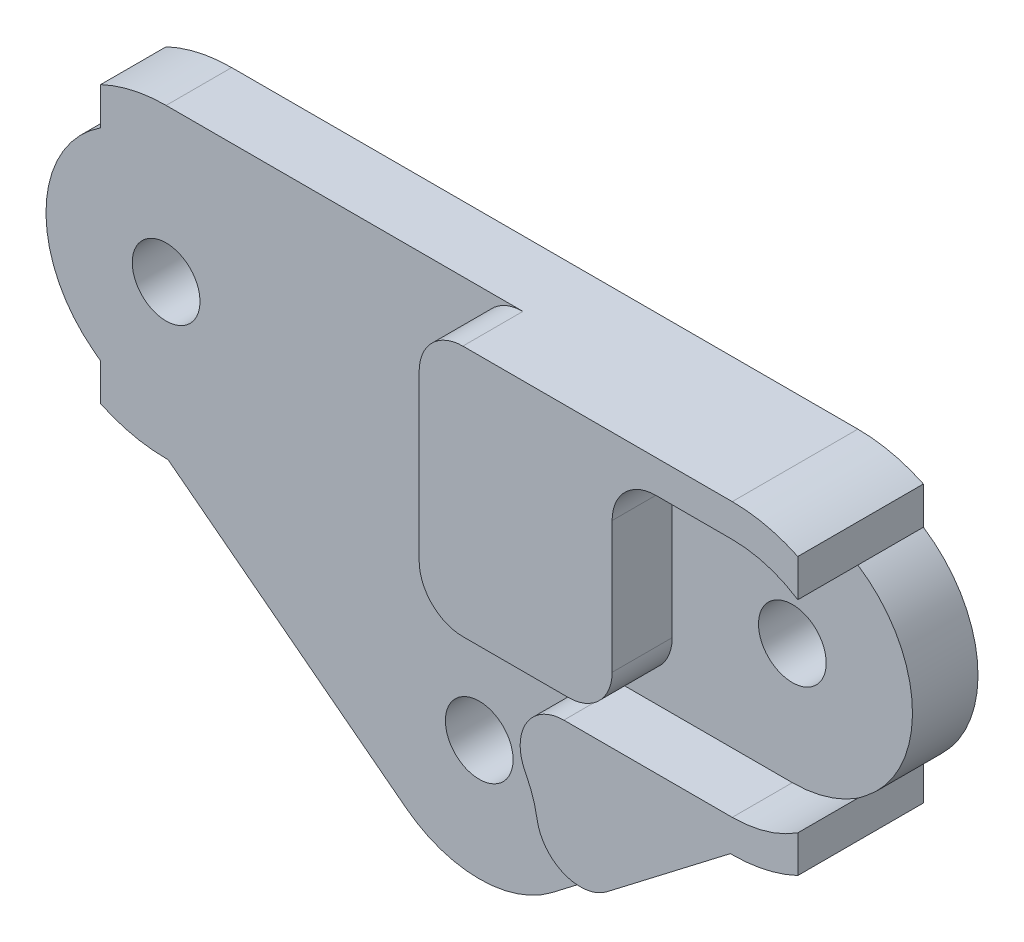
ISO-10303-21;
HEADER;
FILE_DESCRIPTION(('STEP AP214'),'2;1');
FILE_NAME('part.step','',(''),(''),'','','');
FILE_SCHEMA(('AUTOMOTIVE_DESIGN { 1 0 10303 214 1 1 1 1 }'));
ENDSEC;
DATA;
#1=APPLICATION_CONTEXT('core data for automotive mechanical design processes');
#2=APPLICATION_PROTOCOL_DEFINITION('international standard','automotive_design',2000,#1);
#3=PRODUCT_CONTEXT('',#1,'mechanical');
#4=PRODUCT('Part','Part','',(#3));
#5=PRODUCT_RELATED_PRODUCT_CATEGORY('part','',(#4));
#6=PRODUCT_DEFINITION_FORMATION('','',#4);
#7=PRODUCT_DEFINITION_CONTEXT('part definition',#1,'design');
#8=PRODUCT_DEFINITION('design','',#6,#7);
#9=PRODUCT_DEFINITION_SHAPE('','',#8);
#10=(LENGTH_UNIT() NAMED_UNIT(*) SI_UNIT(.MILLI.,.METRE.));
#11=(NAMED_UNIT(*) PLANE_ANGLE_UNIT() SI_UNIT($,.RADIAN.));
#12=(NAMED_UNIT(*) SI_UNIT($,.STERADIAN.) SOLID_ANGLE_UNIT());
#13=UNCERTAINTY_MEASURE_WITH_UNIT(LENGTH_MEASURE(1.E-05),#10,'distance_accuracy_value','');
#14=(GEOMETRIC_REPRESENTATION_CONTEXT(3) GLOBAL_UNCERTAINTY_ASSIGNED_CONTEXT((#13)) GLOBAL_UNIT_ASSIGNED_CONTEXT((#10,
#11,#12)) REPRESENTATION_CONTEXT('',''));
#15=CARTESIAN_POINT('',(0.,0.,0.));
#16=DIRECTION('',(0.,0.,1.));
#17=DIRECTION('',(1.,0.,0.));
#18=AXIS2_PLACEMENT_3D('',#15,#16,#17);
#19=CARTESIAN_POINT('',(14.3333333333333,0.,3.));
#20=DIRECTION('',(0.,0.,-1.));
#21=DIRECTION('',(-1.,0.,0.));
#22=AXIS2_PLACEMENT_3D('',#19,#20,#21);
#23=PLANE('',#22);
#24=CARTESIAN_POINT('',(0.,-11.,3.));
#25=DIRECTION('',(0.,0.,1.));
#26=DIRECTION('',(1.,0.,0.));
#27=AXIS2_PLACEMENT_3D('',#24,#25,#26);
#28=CIRCLE('',#27,1.55);
#29=CARTESIAN_POINT('',(1.55,-11.,3.));
#30=VERTEX_POINT('',#29);
#31=EDGE_CURVE('E661',#30,#30,#28,.T.);
#32=ORIENTED_EDGE('',*,*,#31,.F.);
#33=EDGE_LOOP('',(#32));
#34=FACE_BOUND('',#33,.T.);
#35=CARTESIAN_POINT('',(14.3333333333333,0.,3.));
#36=DIRECTION('',(0.,0.,1.));
#37=DIRECTION('',(1.,0.,0.));
#38=AXIS2_PLACEMENT_3D('',#35,#36,#37);
#39=CIRCLE('',#38,1.55);
#40=CARTESIAN_POINT('',(15.8833333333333,0.,3.));
#41=VERTEX_POINT('',#40);
#42=EDGE_CURVE('E669',#41,#41,#39,.T.);
#43=ORIENTED_EDGE('',*,*,#42,.F.);
#44=EDGE_LOOP('',(#43));
#45=FACE_BOUND('',#44,.T.);
#46=CARTESIAN_POINT('',(-14.3333333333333,0.,3.));
#47=DIRECTION('',(0.,0.,1.));
#48=DIRECTION('',(-1.,0.,0.));
#49=AXIS2_PLACEMENT_3D('',#46,#47,#48);
#50=CIRCLE('',#49,1.55);
#51=CARTESIAN_POINT('',(-15.8833333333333,0.,3.));
#52=VERTEX_POINT('',#51);
#53=EDGE_CURVE('E653',#52,#52,#50,.T.);
#54=ORIENTED_EDGE('',*,*,#53,.F.);
#55=EDGE_LOOP('',(#54));
#56=FACE_BOUND('',#55,.T.);
#57=DIRECTION('',(1.,0.,0.));
#58=VECTOR('',#57,1.);
#59=CARTESIAN_POINT('',(14.3333333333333,5.5,3.));
#60=LINE('',#59,#58);
#61=CARTESIAN_POINT('',(10.8333333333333,5.5,3.));
#62=VERTEX_POINT('',#61);
#63=CARTESIAN_POINT('',(14.3333333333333,5.5,3.));
#64=VERTEX_POINT('',#63);
#65=EDGE_CURVE('E395',#62,#64,#60,.T.);
#66=ORIENTED_EDGE('',*,*,#65,.F.);
#67=CARTESIAN_POINT('',(10.8333333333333,3.5,3.));
#68=DIRECTION('',(0.,0.,-1.));
#69=DIRECTION('',(-1.,0.,0.));
#70=AXIS2_PLACEMENT_3D('',#67,#68,#69);
#71=CIRCLE('',#70,2.);
#72=CARTESIAN_POINT('',(8.83333333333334,3.5,3.));
#73=VERTEX_POINT('',#72);
#74=EDGE_CURVE('E59',#62,#73,#71,.F.);
#75=ORIENTED_EDGE('',*,*,#74,.T.);
#76=DIRECTION('',(0.,1.,0.));
#77=VECTOR('',#76,1.);
#78=CARTESIAN_POINT('',(8.83333333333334,5.5,3.));
#79=LINE('',#78,#77);
#80=CARTESIAN_POINT('',(8.83333333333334,-2.51751640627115,3.));
#81=VERTEX_POINT('',#80);
#82=EDGE_CURVE('E431',#81,#73,#79,.T.);
#83=ORIENTED_EDGE('',*,*,#82,.F.);
#84=CARTESIAN_POINT('',(6.83333333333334,-2.51751640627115,3.));
#85=DIRECTION('',(0.,0.,-1.));
#86=DIRECTION('',(-1.,0.,0.));
#87=AXIS2_PLACEMENT_3D('',#84,#85,#86);
#88=CIRCLE('',#87,2.);
#89=CARTESIAN_POINT('',(6.83333333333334,-4.51751640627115,3.));
#90=VERTEX_POINT('',#89);
#91=EDGE_CURVE('E49',#81,#90,#88,.T.);
#92=ORIENTED_EDGE('',*,*,#91,.T.);
#93=DIRECTION('',(1.,0.,0.));
#94=VECTOR('',#93,1.);
#95=CARTESIAN_POINT('',(8.83333333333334,-4.51751640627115,3.));
#96=LINE('',#95,#94);
#97=CARTESIAN_POINT('',(2.,-4.51751640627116,3.));
#98=VERTEX_POINT('',#97);
#99=EDGE_CURVE('E427',#98,#90,#96,.T.);
#100=ORIENTED_EDGE('',*,*,#99,.F.);
#101=CARTESIAN_POINT('',(2.,-2.51751640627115,3.));
#102=DIRECTION('',(0.,0.,-1.));
#103=DIRECTION('',(-1.,0.,0.));
#104=AXIS2_PLACEMENT_3D('',#101,#102,#103);
#105=CIRCLE('',#104,2.);
#106=CARTESIAN_POINT('',(0.,-2.51751640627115,3.));
#107=VERTEX_POINT('',#106);
#108=EDGE_CURVE('E582',#98,#107,#105,.T.);
#109=ORIENTED_EDGE('',*,*,#108,.T.);
#110=DIRECTION('',(0.,-1.,0.));
#111=VECTOR('',#110,1.);
#112=CARTESIAN_POINT('',(0.,-4.51751640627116,3.));
#113=LINE('',#112,#111);
#114=CARTESIAN_POINT('',(0.,5.,3.));
#115=VERTEX_POINT('',#114);
#116=EDGE_CURVE('E426',#115,#107,#113,.T.);
#117=ORIENTED_EDGE('',*,*,#116,.F.);
#118=CARTESIAN_POINT('',(2.,5.,3.));
#119=DIRECTION('',(0.,0.,-1.));
#120=DIRECTION('',(-1.,0.,0.));
#121=AXIS2_PLACEMENT_3D('',#118,#119,#120);
#122=CIRCLE('',#121,2.);
#123=CARTESIAN_POINT('',(2.,7.,3.));
#124=VERTEX_POINT('',#123);
#125=EDGE_CURVE('E578',#115,#124,#122,.T.);
#126=ORIENTED_EDGE('',*,*,#125,.T.);
#127=DIRECTION('',(-1.,0.,0.));
#128=VECTOR('',#127,1.);
#129=CARTESIAN_POINT('',(0.,7.,3.));
#130=LINE('',#129,#128);
#131=CARTESIAN_POINT('',(-14.3333333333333,7.,3.));
#132=VERTEX_POINT('',#131);
#133=EDGE_CURVE('E506',#124,#132,#130,.T.);
#134=ORIENTED_EDGE('',*,*,#133,.T.);
#135=CARTESIAN_POINT('',(-14.3333333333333,0.,3.));
#136=DIRECTION('',(0.,0.,1.));
#137=DIRECTION('',(1.,0.,0.));
#138=AXIS2_PLACEMENT_3D('',#135,#136,#137);
#139=CIRCLE('',#138,6.99999999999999);
#140=CARTESIAN_POINT('',(-17.3333333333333,6.32455532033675,3.));
#141=VERTEX_POINT('',#140);
#142=EDGE_CURVE('E502',#132,#141,#139,.T.);
#143=ORIENTED_EDGE('',*,*,#142,.T.);
#144=DIRECTION('',(0.,-1.,0.));
#145=VECTOR('',#144,1.);
#146=CARTESIAN_POINT('',(-17.3333333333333,0.,3.));
#147=LINE('',#146,#145);
#148=CARTESIAN_POINT('',(-17.3333333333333,4.60977222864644,3.));
#149=VERTEX_POINT('',#148);
#150=EDGE_CURVE('E497',#141,#149,#147,.T.);
#151=ORIENTED_EDGE('',*,*,#150,.T.);
#152=CARTESIAN_POINT('',(-14.3333333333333,0.,3.));
#153=DIRECTION('',(0.,0.,1.));
#154=DIRECTION('',(1.,0.,0.));
#155=AXIS2_PLACEMENT_3D('',#152,#153,#154);
#156=CIRCLE('',#155,5.5);
#157=CARTESIAN_POINT('',(-17.6818366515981,-4.36320129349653,3.));
#158=VERTEX_POINT('',#157);
#159=EDGE_CURVE('E681',#149,#158,#156,.T.);
#160=ORIENTED_EDGE('',*,*,#159,.T.);
#161=DIRECTION('',(0.793309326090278,-0.60881878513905,0.));
#162=VECTOR('',#161,1.);
#163=CARTESIAN_POINT('',(-3.34850331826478,-15.3632012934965,3.));
#164=LINE('',#163,#162);
#165=CARTESIAN_POINT('',(-17.3333333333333,-4.63065732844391,3.));
#166=VERTEX_POINT('',#165);
#167=EDGE_CURVE('E685',#158,#166,#164,.T.);
#168=ORIENTED_EDGE('',*,*,#167,.T.);
#169=DIRECTION('',(0.,-1.,0.));
#170=VECTOR('',#169,1.);
#171=CARTESIAN_POINT('',(-17.3333333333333,0.,3.));
#172=LINE('',#171,#170);
#173=CARTESIAN_POINT('',(-17.3333333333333,-6.32455532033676,3.));
#174=VERTEX_POINT('',#173);
#175=EDGE_CURVE('E447',#166,#174,#172,.T.);
#176=ORIENTED_EDGE('',*,*,#175,.T.);
#177=CARTESIAN_POINT('',(-14.3333333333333,0.,3.));
#178=DIRECTION('',(0.,0.,1.));
#179=DIRECTION('',(1.,0.,0.));
#180=AXIS2_PLACEMENT_3D('',#177,#178,#179);
#181=CIRCLE('',#180,7.00000000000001);
#182=CARTESIAN_POINT('',(-14.3333333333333,-7.,3.));
#183=VERTEX_POINT('',#182);
#184=EDGE_CURVE('E467',#174,#183,#181,.T.);
#185=ORIENTED_EDGE('',*,*,#184,.T.);
#186=DIRECTION('',(1.,0.,0.));
#187=VECTOR('',#186,1.);
#188=CARTESIAN_POINT('',(0.,-7.,3.));
#189=LINE('',#188,#187);
#190=CARTESIAN_POINT('',(-14.246008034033,-7.00000000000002,3.));
#191=VERTEX_POINT('',#190);
#192=EDGE_CURVE('E462',#183,#191,#189,.T.);
#193=ORIENTED_EDGE('',*,*,#192,.T.);
#194=CARTESIAN_POINT('',(-3.34850331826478,-15.3632012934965,3.));
#195=VERTEX_POINT('',#194);
#196=EDGE_CURVE('E684',#191,#195,#164,.T.);
#197=ORIENTED_EDGE('',*,*,#196,.T.);
#198=CARTESIAN_POINT('',(0.,-11.,3.));
#199=DIRECTION('',(0.,0.,1.));
#200=DIRECTION('',(1.,0.,0.));
#201=AXIS2_PLACEMENT_3D('',#198,#199,#200);
#202=CIRCLE('',#201,5.5);
#203=CARTESIAN_POINT('',(3.34850331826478,-15.3632012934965,3.));
#204=VERTEX_POINT('',#203);
#205=EDGE_CURVE('E689',#195,#204,#202,.T.);
#206=ORIENTED_EDGE('',*,*,#205,.T.);
#207=DIRECTION('',(0.793309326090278,0.608818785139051,0.));
#208=VECTOR('',#207,1.);
#209=CARTESIAN_POINT('',(3.34850331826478,-15.3632012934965,3.));
#210=LINE('',#209,#208);
#211=CARTESIAN_POINT('',(8.59500527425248,-11.3368160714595,3.));
#212=VERTEX_POINT('',#211);
#213=EDGE_CURVE('E693',#204,#212,#210,.T.);
#214=ORIENTED_EDGE('',*,*,#213,.T.);
#215=CARTESIAN_POINT('',(7.37736770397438,-9.75019741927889,3.));
#216=DIRECTION('',(0.,0.,-1.));
#217=DIRECTION('',(-1.,0.,0.));
#218=AXIS2_PLACEMENT_3D('',#215,#216,#217);
#219=CIRCLE('',#218,2.);
#220=CARTESIAN_POINT('',(5.40546422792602,-10.0842583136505,3.));
#221=VERTEX_POINT('',#220);
#222=EDGE_CURVE('E588',#212,#221,#219,.T.);
#223=ORIENTED_EDGE('',*,*,#222,.T.);
#224=CARTESIAN_POINT('',(0.,-11.,3.));
#225=DIRECTION('',(0.,0.,-1.));
#226=DIRECTION('',(-1.,0.,0.));
#227=AXIS2_PLACEMENT_3D('',#224,#225,#226);
#228=CIRCLE('',#227,5.48248359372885);
#229=CARTESIAN_POINT('',(4.85249650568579,-8.44835268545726,3.));
#230=VERTEX_POINT('',#229);
#231=EDGE_CURVE('E372',#230,#221,#228,.T.);
#232=ORIENTED_EDGE('',*,*,#231,.F.);
#233=CARTESIAN_POINT('',(6.62267836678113,-7.51751640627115,3.));
#234=DIRECTION('',(0.,0.,-1.));
#235=DIRECTION('',(-1.,0.,0.));
#236=AXIS2_PLACEMENT_3D('',#233,#234,#235);
#237=CIRCLE('',#236,2.);
#238=CARTESIAN_POINT('',(6.62267836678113,-5.51751640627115,3.));
#239=VERTEX_POINT('',#238);
#240=EDGE_CURVE('E585',#230,#239,#237,.T.);
#241=ORIENTED_EDGE('',*,*,#240,.T.);
#242=DIRECTION('',(-1.,0.,0.));
#243=VECTOR('',#242,1.);
#244=CARTESIAN_POINT('',(14.3333333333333,-5.51751640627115,3.));
#245=LINE('',#244,#243);
#246=CARTESIAN_POINT('',(14.3333333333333,-5.51751640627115,3.));
#247=VERTEX_POINT('',#246);
#248=EDGE_CURVE('E379',#247,#239,#245,.T.);
#249=ORIENTED_EDGE('',*,*,#248,.F.);
#250=CARTESIAN_POINT('',(14.3333333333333,0.,3.));
#251=DIRECTION('',(0.,0.,-1.));
#252=DIRECTION('',(-1.,0.,0.));
#253=AXIS2_PLACEMENT_3D('',#250,#251,#252);
#254=CIRCLE('',#253,5.51751640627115);
#255=CARTESIAN_POINT('',(17.3333333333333,-4.63065732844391,3.));
#256=VERTEX_POINT('',#255);
#257=EDGE_CURVE('E376',#256,#247,#254,.T.);
#258=ORIENTED_EDGE('',*,*,#257,.F.);
#259=CARTESIAN_POINT('',(17.6818366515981,-4.36320129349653,3.));
#260=VERTEX_POINT('',#259);
#261=EDGE_CURVE('E692',#256,#260,#210,.T.);
#262=ORIENTED_EDGE('',*,*,#261,.T.);
#263=CARTESIAN_POINT('',(14.3333333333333,0.,3.));
#264=DIRECTION('',(0.,0.,1.));
#265=DIRECTION('',(-1.,0.,0.));
#266=AXIS2_PLACEMENT_3D('',#263,#264,#265);
#267=CIRCLE('',#266,5.5);
#268=CARTESIAN_POINT('',(17.3333333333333,4.60977222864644,3.));
#269=VERTEX_POINT('',#268);
#270=EDGE_CURVE('E677',#260,#269,#267,.T.);
#271=ORIENTED_EDGE('',*,*,#270,.T.);
#272=CARTESIAN_POINT('',(14.3333333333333,0.,3.));
#273=DIRECTION('',(0.,0.,-1.));
#274=DIRECTION('',(-1.,0.,0.));
#275=AXIS2_PLACEMENT_3D('',#272,#273,#274);
#276=CIRCLE('',#275,5.5);
#277=EDGE_CURVE('E389',#64,#269,#276,.T.);
#278=ORIENTED_EDGE('',*,*,#277,.F.);
#279=EDGE_LOOP('',(#66,#75,#83,#92,#100,#109,#117,#126,#134,#143,#151,#160,#168,#176,#185,#193,
#197,#206,#214,#223,#232,#241,#249,#258,#262,#271,#278));
#280=FACE_BOUND('',#279,.T.);
#281=ADVANCED_FACE('F40',(#34,#45,#56,#280),#23,.F.);
#282=CARTESIAN_POINT('',(3.34850331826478,-15.3632012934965,3.));
#283=DIRECTION('',(-0.608818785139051,0.793309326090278,0.));
#284=DIRECTION('',(-0.793309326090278,-0.608818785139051,0.));
#285=AXIS2_PLACEMENT_3D('',#282,#283,#284);
#286=PLANE('',#285);
#287=DIRECTION('',(0.793309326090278,0.60881878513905,0.));
#288=VECTOR('',#287,1.);
#289=CARTESIAN_POINT('',(5.48248359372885,-13.7254955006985,5.75));
#290=LINE('',#289,#288);
#291=CARTESIAN_POINT('',(8.59500527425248,-11.3368160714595,5.75));
#292=VERTEX_POINT('',#291);
#293=CARTESIAN_POINT('',(14.246008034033,-7.,5.75));
#294=VERTEX_POINT('',#293);
#295=EDGE_CURVE('E322',#292,#294,#290,.T.);
#296=ORIENTED_EDGE('',*,*,#295,.F.);
#297=DIRECTION('',(0.,0.,-1.));
#298=VECTOR('',#297,1.);
#299=CARTESIAN_POINT('',(8.59500527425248,-11.3368160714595,3.));
#300=LINE('',#299,#298);
#301=EDGE_CURVE('E563',#292,#212,#300,.T.);
#302=ORIENTED_EDGE('',*,*,#301,.T.);
#303=ORIENTED_EDGE('',*,*,#213,.F.);
#304=DIRECTION('',(0.,0.,-1.));
#305=VECTOR('',#304,1.);
#306=CARTESIAN_POINT('',(3.34850331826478,-15.3632012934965,3.));
#307=LINE('',#306,#305);
#308=CARTESIAN_POINT('',(3.34850331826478,-15.3632012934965,0.));
#309=VERTEX_POINT('',#308);
#310=EDGE_CURVE('E717',#204,#309,#307,.T.);
#311=ORIENTED_EDGE('',*,*,#310,.T.);
#312=DIRECTION('',(0.793309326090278,0.608818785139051,0.));
#313=VECTOR('',#312,1.);
#314=CARTESIAN_POINT('',(3.34850331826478,-15.3632012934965,0.));
#315=LINE('',#314,#313);
#316=CARTESIAN_POINT('',(14.246008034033,-7.,0.));
#317=VERTEX_POINT('',#316);
#318=EDGE_CURVE('E344',#309,#317,#315,.T.);
#319=ORIENTED_EDGE('',*,*,#318,.T.);
#320=DIRECTION('',(0.,0.,1.));
#321=VECTOR('',#320,1.);
#322=CARTESIAN_POINT('',(14.246008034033,-7.,-34.748970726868));
#323=LINE('',#322,#321);
#324=EDGE_CURVE('E340',#317,#294,#323,.T.);
#325=ORIENTED_EDGE('',*,*,#324,.T.);
#326=EDGE_LOOP('',(#296,#302,#303,#311,#319,#325));
#327=FACE_BOUND('',#326,.T.);
#328=ADVANCED_FACE('F341',(#327),#286,.F.);
#329=DIRECTION('',(0.,0.,1.));
#330=VECTOR('',#329,1.);
#331=CARTESIAN_POINT('',(17.3333333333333,-4.63065732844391,-34.748970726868));
#332=LINE('',#331,#330);
#333=CARTESIAN_POINT('',(17.3333333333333,-4.63065732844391,0.));
#334=VERTEX_POINT('',#333);
#335=EDGE_CURVE('E348',#334,#256,#332,.T.);
#336=ORIENTED_EDGE('',*,*,#335,.F.);
#337=CARTESIAN_POINT('',(17.6818366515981,-4.36320129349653,0.));
#338=VERTEX_POINT('',#337);
#339=EDGE_CURVE('E711',#334,#338,#315,.T.);
#340=ORIENTED_EDGE('',*,*,#339,.T.);
#341=DIRECTION('',(0.,0.,-1.));
#342=VECTOR('',#341,1.);
#343=CARTESIAN_POINT('',(17.6818366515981,-4.36320129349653,3.));
#344=LINE('',#343,#342);
#345=EDGE_CURVE('E696',#260,#338,#344,.T.);
#346=ORIENTED_EDGE('',*,*,#345,.F.);
#347=ORIENTED_EDGE('',*,*,#261,.F.);
#348=EDGE_LOOP('',(#336,#340,#346,#347));
#349=FACE_BOUND('',#348,.T.);
#350=ADVANCED_FACE('F788',(#349),#286,.F.);
#351=CARTESIAN_POINT('',(-3.34850331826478,-15.3632012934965,3.));
#352=DIRECTION('',(0.60881878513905,0.793309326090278,0.));
#353=DIRECTION('',(-0.793309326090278,0.60881878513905,0.));
#354=AXIS2_PLACEMENT_3D('',#351,#352,#353);
#355=PLANE('',#354);
#356=ORIENTED_EDGE('',*,*,#196,.F.);
#357=DIRECTION('',(0.,0.,1.));
#358=VECTOR('',#357,1.);
#359=CARTESIAN_POINT('',(-14.246008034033,-7.00000000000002,-34.748970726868));
#360=LINE('',#359,#358);
#361=CARTESIAN_POINT('',(-14.246008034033,-7.,0.));
#362=VERTEX_POINT('',#361);
#363=EDGE_CURVE('E487',#362,#191,#360,.T.);
#364=ORIENTED_EDGE('',*,*,#363,.F.);
#365=DIRECTION('',(0.793309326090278,-0.60881878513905,0.));
#366=VECTOR('',#365,1.);
#367=CARTESIAN_POINT('',(-3.34850331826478,-15.3632012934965,0.));
#368=LINE('',#367,#366);
#369=CARTESIAN_POINT('',(-3.34850331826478,-15.3632012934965,0.));
#370=VERTEX_POINT('',#369);
#371=EDGE_CURVE('E703',#362,#370,#368,.T.);
#372=ORIENTED_EDGE('',*,*,#371,.T.);
#373=DIRECTION('',(0.,0.,-1.));
#374=VECTOR('',#373,1.);
#375=CARTESIAN_POINT('',(-3.34850331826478,-15.3632012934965,3.));
#376=LINE('',#375,#374);
#377=EDGE_CURVE('E719',#195,#370,#376,.T.);
#378=ORIENTED_EDGE('',*,*,#377,.F.);
#379=EDGE_LOOP('',(#356,#364,#372,#378));
#380=FACE_BOUND('',#379,.T.);
#381=ADVANCED_FACE('F805',(#380),#355,.F.);
#382=CARTESIAN_POINT('',(14.3333333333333,0.,3.));
#383=DIRECTION('',(0.,0.,-1.));
#384=DIRECTION('',(-1.,0.,0.));
#385=AXIS2_PLACEMENT_3D('',#382,#383,#384);
#386=CYLINDRICAL_SURFACE('',#385,5.5);
#387=DIRECTION('',(0.,0.,1.));
#388=VECTOR('',#387,1.);
#389=CARTESIAN_POINT('',(17.3333333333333,4.60977222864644,-34.748970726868));
#390=LINE('',#389,#388);
#391=CARTESIAN_POINT('',(17.3333333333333,4.60977222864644,0.));
#392=VERTEX_POINT('',#391);
#393=EDGE_CURVE('E635',#392,#269,#390,.T.);
#394=ORIENTED_EDGE('',*,*,#393,.T.);
#395=ORIENTED_EDGE('',*,*,#270,.F.);
#396=ORIENTED_EDGE('',*,*,#345,.T.);
#397=CARTESIAN_POINT('',(14.3333333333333,0.,0.));
#398=DIRECTION('',(0.,0.,1.));
#399=DIRECTION('',(-1.,0.,0.));
#400=AXIS2_PLACEMENT_3D('',#397,#398,#399);
#401=CIRCLE('',#400,5.5);
#402=EDGE_CURVE('E673',#338,#392,#401,.T.);
#403=ORIENTED_EDGE('',*,*,#402,.T.);
#404=EDGE_LOOP('',(#394,#395,#396,#403));
#405=FACE_BOUND('',#404,.T.);
#406=ADVANCED_FACE('F797',(#405),#386,.T.);
#407=CARTESIAN_POINT('',(14.3333333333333,0.,0.));
#408=DIRECTION('',(0.,0.,-1.));
#409=DIRECTION('',(-1.,0.,0.));
#410=AXIS2_PLACEMENT_3D('',#407,#408,#409);
#411=PLANE('',#410);
#412=CARTESIAN_POINT('',(0.,-11.,0.));
#413=DIRECTION('',(0.,0.,1.));
#414=DIRECTION('',(1.,0.,0.));
#415=AXIS2_PLACEMENT_3D('',#412,#413,#414);
#416=CIRCLE('',#415,1.55);
#417=CARTESIAN_POINT('',(1.55,-11.,0.));
#418=VERTEX_POINT('',#417);
#419=EDGE_CURVE('E657',#418,#418,#416,.T.);
#420=ORIENTED_EDGE('',*,*,#419,.T.);
#421=EDGE_LOOP('',(#420));
#422=FACE_BOUND('',#421,.T.);
#423=ORIENTED_EDGE('',*,*,#402,.F.);
#424=ORIENTED_EDGE('',*,*,#339,.F.);
#425=DIRECTION('',(0.,-1.,0.));
#426=VECTOR('',#425,1.);
#427=CARTESIAN_POINT('',(17.3333333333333,0.,0.));
#428=LINE('',#427,#426);
#429=CARTESIAN_POINT('',(17.3333333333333,-6.32455532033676,0.));
#430=VERTEX_POINT('',#429);
#431=EDGE_CURVE('E452',#334,#430,#428,.T.);
#432=ORIENTED_EDGE('',*,*,#431,.T.);
#433=CARTESIAN_POINT('',(14.3333333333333,0.,0.));
#434=DIRECTION('',(0.,0.,-1.));
#435=DIRECTION('',(-1.,0.,0.));
#436=AXIS2_PLACEMENT_3D('',#433,#434,#435);
#437=CIRCLE('',#436,7.);
#438=CARTESIAN_POINT('',(14.3333333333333,-7.,0.));
#439=VERTEX_POINT('',#438);
#440=EDGE_CURVE('E448',#430,#439,#437,.T.);
#441=ORIENTED_EDGE('',*,*,#440,.T.);
#442=DIRECTION('',(-1.,0.,0.));
#443=VECTOR('',#442,1.);
#444=CARTESIAN_POINT('',(0.,-7.,0.));
#445=LINE('',#444,#443);
#446=EDGE_CURVE('E444',#439,#317,#445,.T.);
#447=ORIENTED_EDGE('',*,*,#446,.T.);
#448=ORIENTED_EDGE('',*,*,#318,.F.);
#449=CARTESIAN_POINT('',(0.,-11.,0.));
#450=DIRECTION('',(0.,0.,1.));
#451=DIRECTION('',(1.,0.,0.));
#452=AXIS2_PLACEMENT_3D('',#449,#450,#451);
#453=CIRCLE('',#452,5.5);
#454=EDGE_CURVE('E708',#370,#309,#453,.T.);
#455=ORIENTED_EDGE('',*,*,#454,.F.);
#456=ORIENTED_EDGE('',*,*,#371,.F.);
#457=DIRECTION('',(1.,0.,0.));
#458=VECTOR('',#457,1.);
#459=CARTESIAN_POINT('',(0.,-7.,0.));
#460=LINE('',#459,#458);
#461=CARTESIAN_POINT('',(-14.3333333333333,-7.,0.));
#462=VERTEX_POINT('',#461);
#463=EDGE_CURVE('E484',#462,#362,#460,.T.);
#464=ORIENTED_EDGE('',*,*,#463,.F.);
#465=CARTESIAN_POINT('',(-14.3333333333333,0.,0.));
#466=DIRECTION('',(0.,0.,-1.));
#467=DIRECTION('',(-1.,0.,0.));
#468=AXIS2_PLACEMENT_3D('',#465,#466,#467);
#469=CIRCLE('',#468,7.00000000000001);
#470=CARTESIAN_POINT('',(-17.3333333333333,-6.32455532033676,0.));
#471=VERTEX_POINT('',#470);
#472=EDGE_CURVE('E466',#471,#462,#469,.F.);
#473=ORIENTED_EDGE('',*,*,#472,.F.);
#474=DIRECTION('',(0.,-1.,0.));
#475=VECTOR('',#474,1.);
#476=CARTESIAN_POINT('',(-17.3333333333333,0.,0.));
#477=LINE('',#476,#475);
#478=CARTESIAN_POINT('',(-17.3333333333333,-4.63065732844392,0.));
#479=VERTEX_POINT('',#478);
#480=EDGE_CURVE('E478',#479,#471,#477,.T.);
#481=ORIENTED_EDGE('',*,*,#480,.F.);
#482=CARTESIAN_POINT('',(-17.6818366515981,-4.36320129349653,0.));
#483=VERTEX_POINT('',#482);
#484=EDGE_CURVE('E704',#483,#479,#368,.T.);
#485=ORIENTED_EDGE('',*,*,#484,.F.);
#486=CARTESIAN_POINT('',(-14.3333333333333,0.,0.));
#487=DIRECTION('',(0.,0.,1.));
#488=DIRECTION('',(1.,0.,0.));
#489=AXIS2_PLACEMENT_3D('',#486,#487,#488);
#490=CIRCLE('',#489,5.5);
#491=CARTESIAN_POINT('',(-17.3333333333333,4.60977222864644,0.));
#492=VERTEX_POINT('',#491);
#493=EDGE_CURVE('E700',#492,#483,#490,.T.);
#494=ORIENTED_EDGE('',*,*,#493,.F.);
#495=DIRECTION('',(0.,-1.,0.));
#496=VECTOR('',#495,1.);
#497=CARTESIAN_POINT('',(-17.3333333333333,0.,0.));
#498=LINE('',#497,#496);
#499=CARTESIAN_POINT('',(-17.3333333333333,6.32455532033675,0.));
#500=VERTEX_POINT('',#499);
#501=EDGE_CURVE('E638',#500,#492,#498,.T.);
#502=ORIENTED_EDGE('',*,*,#501,.F.);
#503=CARTESIAN_POINT('',(-14.3333333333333,0.,0.));
#504=DIRECTION('',(0.,0.,-1.));
#505=DIRECTION('',(-1.,0.,0.));
#506=AXIS2_PLACEMENT_3D('',#503,#504,#505);
#507=CIRCLE('',#506,6.99999999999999);
#508=CARTESIAN_POINT('',(-14.3333333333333,7.,0.));
#509=VERTEX_POINT('',#508);
#510=EDGE_CURVE('E501',#509,#500,#507,.F.);
#511=ORIENTED_EDGE('',*,*,#510,.F.);
#512=DIRECTION('',(-1.,0.,0.));
#513=VECTOR('',#512,1.);
#514=CARTESIAN_POINT('',(0.,7.,0.));
#515=LINE('',#514,#513);
#516=CARTESIAN_POINT('',(14.3333333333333,7.,0.));
#517=VERTEX_POINT('',#516);
#518=EDGE_CURVE('E630',#517,#509,#515,.T.);
#519=ORIENTED_EDGE('',*,*,#518,.F.);
#520=CARTESIAN_POINT('',(14.3333333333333,0.,0.));
#521=DIRECTION('',(0.,0.,-1.));
#522=DIRECTION('',(-1.,0.,0.));
#523=AXIS2_PLACEMENT_3D('',#520,#521,#522);
#524=CIRCLE('',#523,7.);
#525=CARTESIAN_POINT('',(17.3333333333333,6.32455532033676,0.));
#526=VERTEX_POINT('',#525);
#527=EDGE_CURVE('E496',#517,#526,#524,.T.);
#528=ORIENTED_EDGE('',*,*,#527,.T.);
#529=DIRECTION('',(0.,-1.,0.));
#530=VECTOR('',#529,1.);
#531=CARTESIAN_POINT('',(17.3333333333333,0.,0.));
#532=LINE('',#531,#530);
#533=EDGE_CURVE('E514',#526,#392,#532,.T.);
#534=ORIENTED_EDGE('',*,*,#533,.T.);
#535=EDGE_LOOP('',(#423,#424,#432,#441,#447,#448,#455,#456,#464,#473,#481,#485,#494,#502,#511,
#519,#528,#534));
#536=FACE_BOUND('',#535,.T.);
#537=CARTESIAN_POINT('',(14.3333333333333,0.,0.));
#538=DIRECTION('',(0.,0.,1.));
#539=DIRECTION('',(1.,0.,0.));
#540=AXIS2_PLACEMENT_3D('',#537,#538,#539);
#541=CIRCLE('',#540,1.55);
#542=CARTESIAN_POINT('',(15.8833333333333,0.,0.));
#543=VERTEX_POINT('',#542);
#544=EDGE_CURVE('E665',#543,#543,#541,.T.);
#545=ORIENTED_EDGE('',*,*,#544,.T.);
#546=EDGE_LOOP('',(#545));
#547=FACE_BOUND('',#546,.T.);
#548=CARTESIAN_POINT('',(-14.3333333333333,0.,0.));
#549=DIRECTION('',(0.,0.,1.));
#550=DIRECTION('',(-1.,0.,0.));
#551=AXIS2_PLACEMENT_3D('',#548,#549,#550);
#552=CIRCLE('',#551,1.55);
#553=CARTESIAN_POINT('',(-15.8833333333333,0.,0.));
#554=VERTEX_POINT('',#553);
#555=EDGE_CURVE('E652',#554,#554,#552,.T.);
#556=ORIENTED_EDGE('',*,*,#555,.T.);
#557=EDGE_LOOP('',(#556));
#558=FACE_BOUND('',#557,.T.);
#559=ADVANCED_FACE('F738',(#422,#536,#547,#558),#411,.T.);
#560=CARTESIAN_POINT('',(-14.3333333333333,0.,3.));
#561=DIRECTION('',(0.,0.,-1.));
#562=DIRECTION('',(-1.,0.,0.));
#563=AXIS2_PLACEMENT_3D('',#560,#561,#562);
#564=CYLINDRICAL_SURFACE('',#563,5.5);
#565=ORIENTED_EDGE('',*,*,#159,.F.);
#566=DIRECTION('',(0.,0.,1.));
#567=VECTOR('',#566,1.);
#568=CARTESIAN_POINT('',(-17.3333333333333,4.60977222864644,-34.748970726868));
#569=LINE('',#568,#567);
#570=EDGE_CURVE('E643',#492,#149,#569,.T.);
#571=ORIENTED_EDGE('',*,*,#570,.F.);
#572=ORIENTED_EDGE('',*,*,#493,.T.);
#573=DIRECTION('',(0.,0.,-1.));
#574=VECTOR('',#573,1.);
#575=CARTESIAN_POINT('',(-17.6818366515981,-4.36320129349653,3.));
#576=LINE('',#575,#574);
#577=EDGE_CURVE('E515',#158,#483,#576,.T.);
#578=ORIENTED_EDGE('',*,*,#577,.F.);
#579=EDGE_LOOP('',(#565,#571,#572,#578));
#580=FACE_BOUND('',#579,.T.);
#581=ADVANCED_FACE('F746',(#580),#564,.T.);
#582=ORIENTED_EDGE('',*,*,#484,.T.);
#583=DIRECTION('',(0.,0.,1.));
#584=VECTOR('',#583,1.);
#585=CARTESIAN_POINT('',(-17.3333333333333,-4.63065732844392,-34.748970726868));
#586=LINE('',#585,#584);
#587=EDGE_CURVE('E483',#479,#166,#586,.T.);
#588=ORIENTED_EDGE('',*,*,#587,.T.);
#589=ORIENTED_EDGE('',*,*,#167,.F.);
#590=ORIENTED_EDGE('',*,*,#577,.T.);
#591=EDGE_LOOP('',(#582,#588,#589,#590));
#592=FACE_BOUND('',#591,.T.);
#593=ADVANCED_FACE('F732',(#592),#355,.F.);
#594=CARTESIAN_POINT('',(0.,-11.,3.));
#595=DIRECTION('',(0.,0.,-1.));
#596=DIRECTION('',(-1.,0.,0.));
#597=AXIS2_PLACEMENT_3D('',#594,#595,#596);
#598=CYLINDRICAL_SURFACE('',#597,5.5);
#599=ORIENTED_EDGE('',*,*,#454,.T.);
#600=ORIENTED_EDGE('',*,*,#310,.F.);
#601=ORIENTED_EDGE('',*,*,#205,.F.);
#602=ORIENTED_EDGE('',*,*,#377,.T.);
#603=EDGE_LOOP('',(#599,#600,#601,#602));
#604=FACE_BOUND('',#603,.T.);
#605=ADVANCED_FACE('F800',(#604),#598,.T.);
#606=CARTESIAN_POINT('',(14.3333333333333,0.,3.));
#607=DIRECTION('',(0.,0.,-1.));
#608=DIRECTION('',(-1.,0.,0.));
#609=AXIS2_PLACEMENT_3D('',#606,#607,#608);
#610=CYLINDRICAL_SURFACE('',#609,1.55);
#611=ORIENTED_EDGE('',*,*,#42,.T.);
#612=EDGE_LOOP('',(#611));
#613=FACE_BOUND('',#612,.T.);
#614=ORIENTED_EDGE('',*,*,#544,.F.);
#615=EDGE_LOOP('',(#614));
#616=FACE_BOUND('',#615,.T.);
#617=ADVANCED_FACE('F794',(#613,#616),#610,.F.);
#618=CARTESIAN_POINT('',(0.,-11.,3.));
#619=DIRECTION('',(0.,0.,-1.));
#620=DIRECTION('',(-1.,0.,0.));
#621=AXIS2_PLACEMENT_3D('',#618,#619,#620);
#622=CYLINDRICAL_SURFACE('',#621,1.55);
#623=ORIENTED_EDGE('',*,*,#31,.T.);
#624=EDGE_LOOP('',(#623));
#625=FACE_BOUND('',#624,.T.);
#626=ORIENTED_EDGE('',*,*,#419,.F.);
#627=EDGE_LOOP('',(#626));
#628=FACE_BOUND('',#627,.T.);
#629=ADVANCED_FACE('F834',(#625,#628),#622,.F.);
#630=CARTESIAN_POINT('',(-14.3333333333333,0.,3.));
#631=DIRECTION('',(0.,0.,-1.));
#632=DIRECTION('',(-1.,0.,0.));
#633=AXIS2_PLACEMENT_3D('',#630,#631,#632);
#634=CYLINDRICAL_SURFACE('',#633,1.55);
#635=ORIENTED_EDGE('',*,*,#53,.T.);
#636=EDGE_LOOP('',(#635));
#637=FACE_BOUND('',#636,.T.);
#638=ORIENTED_EDGE('',*,*,#555,.F.);
#639=EDGE_LOOP('',(#638));
#640=FACE_BOUND('',#639,.T.);
#641=ADVANCED_FACE('F832',(#637,#640),#634,.F.);
#642=CARTESIAN_POINT('',(-14.3333333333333,0.,-34.748970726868));
#643=DIRECTION('',(0.,0.,1.));
#644=DIRECTION('',(1.,0.,0.));
#645=AXIS2_PLACEMENT_3D('',#642,#643,#644);
#646=CYLINDRICAL_SURFACE('',#645,6.99999999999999);
#647=DIRECTION('',(0.,0.,1.));
#648=VECTOR('',#647,1.);
#649=CARTESIAN_POINT('',(-14.3333333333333,7.,-34.748970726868));
#650=LINE('',#649,#648);
#651=EDGE_CURVE('E633',#509,#132,#650,.T.);
#652=ORIENTED_EDGE('',*,*,#651,.F.);
#653=ORIENTED_EDGE('',*,*,#510,.T.);
#654=DIRECTION('',(0.,0.,1.));
#655=VECTOR('',#654,1.);
#656=CARTESIAN_POINT('',(-17.3333333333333,6.32455532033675,-34.748970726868));
#657=LINE('',#656,#655);
#658=EDGE_CURVE('E646',#500,#141,#657,.T.);
#659=ORIENTED_EDGE('',*,*,#658,.T.);
#660=ORIENTED_EDGE('',*,*,#142,.F.);
#661=EDGE_LOOP('',(#652,#653,#659,#660));
#662=FACE_BOUND('',#661,.T.);
#663=ADVANCED_FACE('F755',(#662),#646,.T.);
#664=CARTESIAN_POINT('',(-17.3333333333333,0.,-34.748970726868));
#665=DIRECTION('',(-1.,0.,0.));
#666=DIRECTION('',(0.,0.,1.));
#667=AXIS2_PLACEMENT_3D('',#664,#665,#666);
#668=PLANE('',#667);
#669=ORIENTED_EDGE('',*,*,#658,.F.);
#670=ORIENTED_EDGE('',*,*,#501,.T.);
#671=ORIENTED_EDGE('',*,*,#570,.T.);
#672=ORIENTED_EDGE('',*,*,#150,.F.);
#673=EDGE_LOOP('',(#669,#670,#671,#672));
#674=FACE_BOUND('',#673,.T.);
#675=ADVANCED_FACE('F749',(#674),#668,.T.);
#676=CARTESIAN_POINT('',(17.3333333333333,0.,-34.748970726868));
#677=DIRECTION('',(-1.,0.,0.));
#678=DIRECTION('',(0.,0.,1.));
#679=AXIS2_PLACEMENT_3D('',#676,#677,#678);
#680=PLANE('',#679);
#681=ORIENTED_EDGE('',*,*,#533,.F.);
#682=DIRECTION('',(0.,0.,1.));
#683=VECTOR('',#682,1.);
#684=CARTESIAN_POINT('',(17.3333333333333,6.32455532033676,-34.748970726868));
#685=LINE('',#684,#683);
#686=CARTESIAN_POINT('',(17.3333333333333,6.32455532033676,5.75));
#687=VERTEX_POINT('',#686);
#688=EDGE_CURVE('E623',#526,#687,#685,.T.);
#689=ORIENTED_EDGE('',*,*,#688,.T.);
#690=DIRECTION('',(0.,1.,0.));
#691=VECTOR('',#690,1.);
#692=CARTESIAN_POINT('',(17.3333333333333,6.32455532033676,5.75));
#693=LINE('',#692,#691);
#694=CARTESIAN_POINT('',(17.3333333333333,4.60977222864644,5.75));
#695=VERTEX_POINT('',#694);
#696=EDGE_CURVE('E394',#695,#687,#693,.T.);
#697=ORIENTED_EDGE('',*,*,#696,.F.);
#698=DIRECTION('',(0.,0.,-1.));
#699=VECTOR('',#698,1.);
#700=CARTESIAN_POINT('',(17.3333333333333,4.60977222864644,5.75));
#701=LINE('',#700,#699);
#702=EDGE_CURVE('E439',#695,#269,#701,.T.);
#703=ORIENTED_EDGE('',*,*,#702,.T.);
#704=ORIENTED_EDGE('',*,*,#393,.F.);
#705=EDGE_LOOP('',(#681,#689,#697,#703,#704));
#706=FACE_BOUND('',#705,.T.);
#707=ADVANCED_FACE('F819',(#706),#680,.F.);
#708=CARTESIAN_POINT('',(14.3333333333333,0.,-34.748970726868));
#709=DIRECTION('',(0.,0.,1.));
#710=DIRECTION('',(1.,0.,0.));
#711=AXIS2_PLACEMENT_3D('',#708,#709,#710);
#712=CYLINDRICAL_SURFACE('',#711,7.);
#713=ORIENTED_EDGE('',*,*,#527,.F.);
#714=DIRECTION('',(0.,0.,1.));
#715=VECTOR('',#714,1.);
#716=CARTESIAN_POINT('',(14.3333333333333,7.,-34.748970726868));
#717=LINE('',#716,#715);
#718=CARTESIAN_POINT('',(14.3333333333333,7.,5.75));
#719=VERTEX_POINT('',#718);
#720=EDGE_CURVE('E626',#517,#719,#717,.T.);
#721=ORIENTED_EDGE('',*,*,#720,.T.);
#722=CARTESIAN_POINT('',(14.3333333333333,0.,5.75));
#723=DIRECTION('',(0.,0.,1.));
#724=DIRECTION('',(1.,0.,0.));
#725=AXIS2_PLACEMENT_3D('',#722,#723,#724);
#726=CIRCLE('',#725,7.);
#727=EDGE_CURVE('E399',#687,#719,#726,.T.);
#728=ORIENTED_EDGE('',*,*,#727,.F.);
#729=ORIENTED_EDGE('',*,*,#688,.F.);
#730=EDGE_LOOP('',(#713,#721,#728,#729));
#731=FACE_BOUND('',#730,.T.);
#732=ADVANCED_FACE('F622',(#731),#712,.T.);
#733=CARTESIAN_POINT('',(0.,7.,-34.748970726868));
#734=DIRECTION('',(0.,1.,0.));
#735=DIRECTION('',(-1.,0.,0.));
#736=AXIS2_PLACEMENT_3D('',#733,#734,#735);
#737=PLANE('',#736);
#738=ORIENTED_EDGE('',*,*,#133,.F.);
#739=DIRECTION('',(0.,0.,-1.));
#740=VECTOR('',#739,1.);
#741=CARTESIAN_POINT('',(2.,7.,5.75));
#742=LINE('',#741,#740);
#743=CARTESIAN_POINT('',(2.,7.,5.75));
#744=VERTEX_POINT('',#743);
#745=EDGE_CURVE('E529',#124,#744,#742,.F.);
#746=ORIENTED_EDGE('',*,*,#745,.T.);
#747=DIRECTION('',(-1.,0.,0.));
#748=VECTOR('',#747,1.);
#749=CARTESIAN_POINT('',(14.3333333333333,7.,5.75));
#750=LINE('',#749,#748);
#751=EDGE_CURVE('E403',#719,#744,#750,.T.);
#752=ORIENTED_EDGE('',*,*,#751,.F.);
#753=ORIENTED_EDGE('',*,*,#720,.F.);
#754=ORIENTED_EDGE('',*,*,#518,.T.);
#755=ORIENTED_EDGE('',*,*,#651,.T.);
#756=EDGE_LOOP('',(#738,#746,#752,#753,#754,#755));
#757=FACE_BOUND('',#756,.T.);
#758=ADVANCED_FACE('F757',(#757),#737,.T.);
#759=CARTESIAN_POINT('',(-14.3333333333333,0.,-34.748970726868));
#760=DIRECTION('',(0.,0.,1.));
#761=DIRECTION('',(1.,0.,0.));
#762=AXIS2_PLACEMENT_3D('',#759,#760,#761);
#763=CYLINDRICAL_SURFACE('',#762,7.00000000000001);
#764=DIRECTION('',(0.,0.,1.));
#765=VECTOR('',#764,1.);
#766=CARTESIAN_POINT('',(-17.3333333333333,-6.32455532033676,-34.748970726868));
#767=LINE('',#766,#765);
#768=EDGE_CURVE('E482',#471,#174,#767,.T.);
#769=ORIENTED_EDGE('',*,*,#768,.F.);
#770=ORIENTED_EDGE('',*,*,#472,.T.);
#771=DIRECTION('',(0.,0.,1.));
#772=VECTOR('',#771,1.);
#773=CARTESIAN_POINT('',(-14.3333333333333,-7.,-34.748970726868));
#774=LINE('',#773,#772);
#775=EDGE_CURVE('E477',#462,#183,#774,.T.);
#776=ORIENTED_EDGE('',*,*,#775,.T.);
#777=ORIENTED_EDGE('',*,*,#184,.F.);
#778=EDGE_LOOP('',(#769,#770,#776,#777));
#779=FACE_BOUND('',#778,.T.);
#780=ADVANCED_FACE('F902',(#779),#763,.T.);
#781=CARTESIAN_POINT('',(0.,-7.,-34.748970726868));
#782=DIRECTION('',(0.,-1.,0.));
#783=DIRECTION('',(0.,0.,-1.));
#784=AXIS2_PLACEMENT_3D('',#781,#782,#783);
#785=PLANE('',#784);
#786=ORIENTED_EDGE('',*,*,#775,.F.);
#787=ORIENTED_EDGE('',*,*,#463,.T.);
#788=ORIENTED_EDGE('',*,*,#363,.T.);
#789=ORIENTED_EDGE('',*,*,#192,.F.);
#790=EDGE_LOOP('',(#786,#787,#788,#789));
#791=FACE_BOUND('',#790,.T.);
#792=ADVANCED_FACE('F1094',(#791),#785,.T.);
#793=CARTESIAN_POINT('',(-17.3333333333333,0.,-34.748970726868));
#794=DIRECTION('',(-1.,0.,0.));
#795=DIRECTION('',(0.,0.,1.));
#796=AXIS2_PLACEMENT_3D('',#793,#794,#795);
#797=PLANE('',#796);
#798=ORIENTED_EDGE('',*,*,#587,.F.);
#799=ORIENTED_EDGE('',*,*,#480,.T.);
#800=ORIENTED_EDGE('',*,*,#768,.T.);
#801=ORIENTED_EDGE('',*,*,#175,.F.);
#802=EDGE_LOOP('',(#798,#799,#800,#801));
#803=FACE_BOUND('',#802,.T.);
#804=ADVANCED_FACE('F743',(#803),#797,.T.);
#805=CARTESIAN_POINT('',(14.3333333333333,0.,-34.748970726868));
#806=DIRECTION('',(0.,0.,1.));
#807=DIRECTION('',(1.,0.,0.));
#808=AXIS2_PLACEMENT_3D('',#805,#806,#807);
#809=CYLINDRICAL_SURFACE('',#808,7.);
#810=ORIENTED_EDGE('',*,*,#440,.F.);
#811=DIRECTION('',(0.,0.,1.));
#812=VECTOR('',#811,1.);
#813=CARTESIAN_POINT('',(17.3333333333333,-6.32455532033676,-34.748970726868));
#814=LINE('',#813,#812);
#815=CARTESIAN_POINT('',(17.3333333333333,-6.32455532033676,5.75));
#816=VERTEX_POINT('',#815);
#817=EDGE_CURVE('E443',#430,#816,#814,.T.);
#818=ORIENTED_EDGE('',*,*,#817,.T.);
#819=CARTESIAN_POINT('',(14.3333333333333,0.,5.75));
#820=DIRECTION('',(0.,0.,1.));
#821=DIRECTION('',(1.,0.,0.));
#822=AXIS2_PLACEMENT_3D('',#819,#820,#821);
#823=CIRCLE('',#822,7.);
#824=CARTESIAN_POINT('',(14.3333333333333,-7.,5.75));
#825=VERTEX_POINT('',#824);
#826=EDGE_CURVE('E354',#825,#816,#823,.T.);
#827=ORIENTED_EDGE('',*,*,#826,.F.);
#828=DIRECTION('',(0.,0.,1.));
#829=VECTOR('',#828,1.);
#830=CARTESIAN_POINT('',(14.3333333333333,-7.,-34.748970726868));
#831=LINE('',#830,#829);
#832=EDGE_CURVE('E349',#439,#825,#831,.T.);
#833=ORIENTED_EDGE('',*,*,#832,.F.);
#834=EDGE_LOOP('',(#810,#818,#827,#833));
#835=FACE_BOUND('',#834,.T.);
#836=ADVANCED_FACE('F1053',(#835),#809,.T.);
#837=CARTESIAN_POINT('',(0.,-7.,-34.748970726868));
#838=DIRECTION('',(0.,1.,0.));
#839=DIRECTION('',(0.,0.,1.));
#840=AXIS2_PLACEMENT_3D('',#837,#838,#839);
#841=PLANE('',#840);
#842=ORIENTED_EDGE('',*,*,#446,.F.);
#843=ORIENTED_EDGE('',*,*,#832,.T.);
#844=DIRECTION('',(1.,0.,0.));
#845=VECTOR('',#844,1.);
#846=CARTESIAN_POINT('',(14.246008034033,-7.,5.75));
#847=LINE('',#846,#845);
#848=EDGE_CURVE('E328',#294,#825,#847,.T.);
#849=ORIENTED_EDGE('',*,*,#848,.F.);
#850=ORIENTED_EDGE('',*,*,#324,.F.);
#851=EDGE_LOOP('',(#842,#843,#849,#850));
#852=FACE_BOUND('',#851,.T.);
#853=ADVANCED_FACE('F351',(#852),#841,.F.);
#854=CARTESIAN_POINT('',(17.3333333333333,0.,-34.748970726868));
#855=DIRECTION('',(-1.,0.,0.));
#856=DIRECTION('',(0.,0.,1.));
#857=AXIS2_PLACEMENT_3D('',#854,#855,#856);
#858=PLANE('',#857);
#859=ORIENTED_EDGE('',*,*,#431,.F.);
#860=ORIENTED_EDGE('',*,*,#335,.T.);
#861=DIRECTION('',(0.,0.,-1.));
#862=VECTOR('',#861,1.);
#863=CARTESIAN_POINT('',(17.3333333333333,-4.63065732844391,5.75));
#864=LINE('',#863,#862);
#865=CARTESIAN_POINT('',(17.3333333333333,-4.63065732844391,5.75));
#866=VERTEX_POINT('',#865);
#867=EDGE_CURVE('E386',#866,#256,#864,.T.);
#868=ORIENTED_EDGE('',*,*,#867,.F.);
#869=DIRECTION('',(0.,1.,0.));
#870=VECTOR('',#869,1.);
#871=CARTESIAN_POINT('',(17.3333333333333,-4.63065732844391,5.75));
#872=LINE('',#871,#870);
#873=EDGE_CURVE('E359',#816,#866,#872,.T.);
#874=ORIENTED_EDGE('',*,*,#873,.F.);
#875=ORIENTED_EDGE('',*,*,#817,.F.);
#876=EDGE_LOOP('',(#859,#860,#868,#874,#875));
#877=FACE_BOUND('',#876,.T.);
#878=ADVANCED_FACE('F1067',(#877),#858,.F.);
#879=CARTESIAN_POINT('',(14.3333333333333,0.,5.75));
#880=DIRECTION('',(0.,0.,-1.));
#881=DIRECTION('',(-1.,0.,0.));
#882=AXIS2_PLACEMENT_3D('',#879,#880,#881);
#883=CYLINDRICAL_SURFACE('',#882,5.5);
#884=ORIENTED_EDGE('',*,*,#277,.T.);
#885=ORIENTED_EDGE('',*,*,#702,.F.);
#886=CARTESIAN_POINT('',(14.3333333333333,0.,5.75));
#887=DIRECTION('',(0.,0.,-1.));
#888=DIRECTION('',(-1.,0.,0.));
#889=AXIS2_PLACEMENT_3D('',#886,#887,#888);
#890=CIRCLE('',#889,5.5);
#891=CARTESIAN_POINT('',(14.3333333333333,5.5,5.75));
#892=VERTEX_POINT('',#891);
#893=EDGE_CURVE('E390',#892,#695,#890,.T.);
#894=ORIENTED_EDGE('',*,*,#893,.F.);
#895=DIRECTION('',(0.,0.,-1.));
#896=VECTOR('',#895,1.);
#897=CARTESIAN_POINT('',(14.3333333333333,5.5,5.75));
#898=LINE('',#897,#896);
#899=EDGE_CURVE('E422',#892,#64,#898,.T.);
#900=ORIENTED_EDGE('',*,*,#899,.T.);
#901=EDGE_LOOP('',(#884,#885,#894,#900));
#902=FACE_BOUND('',#901,.T.);
#903=ADVANCED_FACE('F615',(#902),#883,.F.);
#904=CARTESIAN_POINT('',(0.,-4.51751640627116,5.75));
#905=DIRECTION('',(1.,0.,0.));
#906=DIRECTION('',(0.,0.,-1.));
#907=AXIS2_PLACEMENT_3D('',#904,#905,#906);
#908=PLANE('',#907);
#909=DIRECTION('',(0.,-1.,0.));
#910=VECTOR('',#909,1.);
#911=CARTESIAN_POINT('',(0.,-4.51751640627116,5.75));
#912=LINE('',#911,#910);
#913=CARTESIAN_POINT('',(0.,5.,5.75));
#914=VERTEX_POINT('',#913);
#915=CARTESIAN_POINT('',(0.,-2.51751640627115,5.75));
#916=VERTEX_POINT('',#915);
#917=EDGE_CURVE('E407',#914,#916,#912,.T.);
#918=ORIENTED_EDGE('',*,*,#917,.F.);
#919=DIRECTION('',(0.,0.,-1.));
#920=VECTOR('',#919,1.);
#921=CARTESIAN_POINT('',(0.,5.,3.));
#922=LINE('',#921,#920);
#923=EDGE_CURVE('E525',#914,#115,#922,.T.);
#924=ORIENTED_EDGE('',*,*,#923,.T.);
#925=ORIENTED_EDGE('',*,*,#116,.T.);
#926=DIRECTION('',(0.,0.,-1.));
#927=VECTOR('',#926,1.);
#928=CARTESIAN_POINT('',(0.,-2.51751640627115,5.75));
#929=LINE('',#928,#927);
#930=EDGE_CURVE('E522',#107,#916,#929,.F.);
#931=ORIENTED_EDGE('',*,*,#930,.T.);
#932=EDGE_LOOP('',(#918,#924,#925,#931));
#933=FACE_BOUND('',#932,.T.);
#934=ADVANCED_FACE('F767',(#933),#908,.F.);
#935=CARTESIAN_POINT('',(8.83333333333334,-4.51751640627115,5.75));
#936=DIRECTION('',(0.,1.,0.));
#937=DIRECTION('',(-1.,0.,0.));
#938=AXIS2_PLACEMENT_3D('',#935,#936,#937);
#939=PLANE('',#938);
#940=DIRECTION('',(1.,0.,0.));
#941=VECTOR('',#940,1.);
#942=CARTESIAN_POINT('',(8.83333333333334,-4.51751640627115,5.75));
#943=LINE('',#942,#941);
#944=CARTESIAN_POINT('',(2.,-4.51751640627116,5.75));
#945=VERTEX_POINT('',#944);
#946=CARTESIAN_POINT('',(6.83333333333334,-4.51751640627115,5.75));
#947=VERTEX_POINT('',#946);
#948=EDGE_CURVE('E411',#945,#947,#943,.T.);
#949=ORIENTED_EDGE('',*,*,#948,.F.);
#950=DIRECTION('',(0.,0.,-1.));
#951=VECTOR('',#950,1.);
#952=CARTESIAN_POINT('',(2.,-4.51751640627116,5.75));
#953=LINE('',#952,#951);
#954=EDGE_CURVE('E544',#945,#98,#953,.T.);
#955=ORIENTED_EDGE('',*,*,#954,.T.);
#956=ORIENTED_EDGE('',*,*,#99,.T.);
#957=DIRECTION('',(0.,0.,-1.));
#958=VECTOR('',#957,1.);
#959=CARTESIAN_POINT('',(6.83333333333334,-4.51751640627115,5.75));
#960=LINE('',#959,#958);
#961=EDGE_CURVE('E541',#90,#947,#960,.F.);
#962=ORIENTED_EDGE('',*,*,#961,.T.);
#963=EDGE_LOOP('',(#949,#955,#956,#962));
#964=FACE_BOUND('',#963,.T.);
#965=ADVANCED_FACE('F597',(#964),#939,.F.);
#966=CARTESIAN_POINT('',(8.83333333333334,5.5,5.75));
#967=DIRECTION('',(-1.,0.,0.));
#968=DIRECTION('',(0.,-1.,0.));
#969=AXIS2_PLACEMENT_3D('',#966,#967,#968);
#970=PLANE('',#969);
#971=DIRECTION('',(0.,1.,0.));
#972=VECTOR('',#971,1.);
#973=CARTESIAN_POINT('',(8.83333333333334,5.5,5.75));
#974=LINE('',#973,#972);
#975=CARTESIAN_POINT('',(8.83333333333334,-2.51751640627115,5.75));
#976=VERTEX_POINT('',#975);
#977=CARTESIAN_POINT('',(8.83333333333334,3.5,5.75));
#978=VERTEX_POINT('',#977);
#979=EDGE_CURVE('E415',#976,#978,#974,.T.);
#980=ORIENTED_EDGE('',*,*,#979,.F.);
#981=DIRECTION('',(0.,0.,-1.));
#982=VECTOR('',#981,1.);
#983=CARTESIAN_POINT('',(8.83333333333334,-2.51751640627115,5.75));
#984=LINE('',#983,#982);
#985=EDGE_CURVE('E569',#976,#81,#984,.T.);
#986=ORIENTED_EDGE('',*,*,#985,.T.);
#987=ORIENTED_EDGE('',*,*,#82,.T.);
#988=DIRECTION('',(0.,0.,-1.));
#989=VECTOR('',#988,1.);
#990=CARTESIAN_POINT('',(8.83333333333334,3.5,5.75));
#991=LINE('',#990,#989);
#992=EDGE_CURVE('E566',#73,#978,#991,.F.);
#993=ORIENTED_EDGE('',*,*,#992,.T.);
#994=EDGE_LOOP('',(#980,#986,#987,#993));
#995=FACE_BOUND('',#994,.T.);
#996=ADVANCED_FACE('F606',(#995),#970,.F.);
#997=CARTESIAN_POINT('',(14.3333333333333,5.5,5.75));
#998=DIRECTION('',(0.,1.,0.));
#999=DIRECTION('',(-1.,0.,0.));
#1000=AXIS2_PLACEMENT_3D('',#997,#998,#999);
#1001=PLANE('',#1000);
#1002=DIRECTION('',(1.,0.,0.));
#1003=VECTOR('',#1002,1.);
#1004=CARTESIAN_POINT('',(14.3333333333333,5.5,5.75));
#1005=LINE('',#1004,#1003);
#1006=CARTESIAN_POINT('',(10.8333333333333,5.5,5.75));
#1007=VERTEX_POINT('',#1006);
#1008=EDGE_CURVE('E419',#1007,#892,#1005,.T.);
#1009=ORIENTED_EDGE('',*,*,#1008,.F.);
#1010=DIRECTION('',(0.,0.,-1.));
#1011=VECTOR('',#1010,1.);
#1012=CARTESIAN_POINT('',(10.8333333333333,5.5,3.));
#1013=LINE('',#1012,#1011);
#1014=EDGE_CURVE('E573',#1007,#62,#1013,.T.);
#1015=ORIENTED_EDGE('',*,*,#1014,.T.);
#1016=ORIENTED_EDGE('',*,*,#65,.T.);
#1017=ORIENTED_EDGE('',*,*,#899,.F.);
#1018=EDGE_LOOP('',(#1009,#1015,#1016,#1017));
#1019=FACE_BOUND('',#1018,.T.);
#1020=ADVANCED_FACE('F610',(#1019),#1001,.F.);
#1021=CARTESIAN_POINT('',(14.3333333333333,0.,5.75));
#1022=DIRECTION('',(0.,0.,-1.));
#1023=DIRECTION('',(-1.,0.,0.));
#1024=AXIS2_PLACEMENT_3D('',#1021,#1022,#1023);
#1025=PLANE('',#1024);
#1026=ORIENTED_EDGE('',*,*,#751,.T.);
#1027=CARTESIAN_POINT('',(2.,5.,5.75));
#1028=DIRECTION('',(0.,0.,-1.));
#1029=DIRECTION('',(-1.,0.,0.));
#1030=AXIS2_PLACEMENT_3D('',#1027,#1028,#1029);
#1031=CIRCLE('',#1030,2.);
#1032=EDGE_CURVE('E538',#744,#914,#1031,.F.);
#1033=ORIENTED_EDGE('',*,*,#1032,.T.);
#1034=ORIENTED_EDGE('',*,*,#917,.T.);
#1035=CARTESIAN_POINT('',(2.,-2.51751640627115,5.75));
#1036=DIRECTION('',(0.,0.,-1.));
#1037=DIRECTION('',(-1.,0.,0.));
#1038=AXIS2_PLACEMENT_3D('',#1035,#1036,#1037);
#1039=CIRCLE('',#1038,2.);
#1040=EDGE_CURVE('E535',#916,#945,#1039,.F.);
#1041=ORIENTED_EDGE('',*,*,#1040,.T.);
#1042=ORIENTED_EDGE('',*,*,#948,.T.);
#1043=CARTESIAN_POINT('',(6.83333333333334,-2.51751640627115,5.75));
#1044=DIRECTION('',(0.,0.,-1.));
#1045=DIRECTION('',(-1.,0.,0.));
#1046=AXIS2_PLACEMENT_3D('',#1043,#1044,#1045);
#1047=CIRCLE('',#1046,2.);
#1048=EDGE_CURVE('E532',#947,#976,#1047,.F.);
#1049=ORIENTED_EDGE('',*,*,#1048,.T.);
#1050=ORIENTED_EDGE('',*,*,#979,.T.);
#1051=CARTESIAN_POINT('',(10.8333333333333,3.5,5.75));
#1052=DIRECTION('',(0.,0.,-1.));
#1053=DIRECTION('',(-1.,0.,0.));
#1054=AXIS2_PLACEMENT_3D('',#1051,#1052,#1053);
#1055=CIRCLE('',#1054,2.);
#1056=EDGE_CURVE('E11',#978,#1007,#1055,.T.);
#1057=ORIENTED_EDGE('',*,*,#1056,.T.);
#1058=ORIENTED_EDGE('',*,*,#1008,.T.);
#1059=ORIENTED_EDGE('',*,*,#893,.T.);
#1060=ORIENTED_EDGE('',*,*,#696,.T.);
#1061=ORIENTED_EDGE('',*,*,#727,.T.);
#1062=EDGE_LOOP('',(#1026,#1033,#1034,#1041,#1042,#1049,#1050,#1057,#1058,#1059,#1060,#1061));
#1063=FACE_BOUND('',#1062,.T.);
#1064=ADVANCED_FACE('F603',(#1063),#1025,.F.);
#1065=CARTESIAN_POINT('',(0.,-11.,5.75));
#1066=DIRECTION('',(0.,0.,-1.));
#1067=DIRECTION('',(-1.,0.,0.));
#1068=AXIS2_PLACEMENT_3D('',#1065,#1066,#1067);
#1069=CYLINDRICAL_SURFACE('',#1068,5.48248359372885);
#1070=CARTESIAN_POINT('',(0.,-11.,5.75));
#1071=DIRECTION('',(0.,0.,-1.));
#1072=DIRECTION('',(-1.,0.,0.));
#1073=AXIS2_PLACEMENT_3D('',#1070,#1071,#1072);
#1074=CIRCLE('',#1073,5.48248359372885);
#1075=CARTESIAN_POINT('',(4.85249650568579,-8.44835268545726,5.75));
#1076=VERTEX_POINT('',#1075);
#1077=CARTESIAN_POINT('',(5.40546422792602,-10.0842583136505,5.75));
#1078=VERTEX_POINT('',#1077);
#1079=EDGE_CURVE('E337',#1076,#1078,#1074,.T.);
#1080=ORIENTED_EDGE('',*,*,#1079,.F.);
#1081=DIRECTION('',(0.,0.,-1.));
#1082=VECTOR('',#1081,1.);
#1083=CARTESIAN_POINT('',(4.8524965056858,-8.44835268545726,5.75));
#1084=LINE('',#1083,#1082);
#1085=EDGE_CURVE('E551',#1076,#230,#1084,.T.);
#1086=ORIENTED_EDGE('',*,*,#1085,.T.);
#1087=ORIENTED_EDGE('',*,*,#231,.T.);
#1088=DIRECTION('',(0.,0.,-1.));
#1089=VECTOR('',#1088,1.);
#1090=CARTESIAN_POINT('',(5.40546422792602,-10.0842583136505,5.75));
#1091=LINE('',#1090,#1089);
#1092=EDGE_CURVE('E548',#221,#1078,#1091,.F.);
#1093=ORIENTED_EDGE('',*,*,#1092,.T.);
#1094=EDGE_LOOP('',(#1080,#1086,#1087,#1093));
#1095=FACE_BOUND('',#1094,.T.);
#1096=ADVANCED_FACE('F948',(#1095),#1069,.F.);
#1097=CARTESIAN_POINT('',(14.3333333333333,0.,5.75));
#1098=DIRECTION('',(0.,0.,-1.));
#1099=DIRECTION('',(-1.,0.,0.));
#1100=AXIS2_PLACEMENT_3D('',#1097,#1098,#1099);
#1101=CYLINDRICAL_SURFACE('',#1100,5.51751640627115);
#1102=ORIENTED_EDGE('',*,*,#257,.T.);
#1103=DIRECTION('',(0.,0.,-1.));
#1104=VECTOR('',#1103,1.);
#1105=CARTESIAN_POINT('',(14.3333333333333,-5.51751640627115,5.75));
#1106=LINE('',#1105,#1104);
#1107=CARTESIAN_POINT('',(14.3333333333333,-5.51751640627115,5.75));
#1108=VERTEX_POINT('',#1107);
#1109=EDGE_CURVE('E371',#1108,#247,#1106,.T.);
#1110=ORIENTED_EDGE('',*,*,#1109,.F.);
#1111=CARTESIAN_POINT('',(14.3333333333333,0.,5.75));
#1112=DIRECTION('',(0.,0.,-1.));
#1113=DIRECTION('',(-1.,0.,0.));
#1114=AXIS2_PLACEMENT_3D('',#1111,#1112,#1113);
#1115=CIRCLE('',#1114,5.51751640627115);
#1116=EDGE_CURVE('E365',#866,#1108,#1115,.T.);
#1117=ORIENTED_EDGE('',*,*,#1116,.F.);
#1118=ORIENTED_EDGE('',*,*,#867,.T.);
#1119=EDGE_LOOP('',(#1102,#1110,#1117,#1118));
#1120=FACE_BOUND('',#1119,.T.);
#1121=ADVANCED_FACE('F884',(#1120),#1101,.F.);
#1122=CARTESIAN_POINT('',(14.3333333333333,-5.51751640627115,5.75));
#1123=DIRECTION('',(0.,-1.,0.));
#1124=DIRECTION('',(1.,0.,0.));
#1125=AXIS2_PLACEMENT_3D('',#1122,#1123,#1124);
#1126=PLANE('',#1125);
#1127=ORIENTED_EDGE('',*,*,#248,.T.);
#1128=DIRECTION('',(0.,0.,-1.));
#1129=VECTOR('',#1128,1.);
#1130=CARTESIAN_POINT('',(6.62267836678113,-5.51751640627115,5.75));
#1131=LINE('',#1130,#1129);
#1132=CARTESIAN_POINT('',(6.62267836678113,-5.51751640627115,5.75));
#1133=VERTEX_POINT('',#1132);
#1134=EDGE_CURVE('E555',#239,#1133,#1131,.F.);
#1135=ORIENTED_EDGE('',*,*,#1134,.T.);
#1136=DIRECTION('',(-1.,0.,0.));
#1137=VECTOR('',#1136,1.);
#1138=CARTESIAN_POINT('',(14.3333333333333,-5.51751640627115,5.75));
#1139=LINE('',#1138,#1137);
#1140=EDGE_CURVE('E368',#1108,#1133,#1139,.T.);
#1141=ORIENTED_EDGE('',*,*,#1140,.F.);
#1142=ORIENTED_EDGE('',*,*,#1109,.T.);
#1143=EDGE_LOOP('',(#1127,#1135,#1141,#1142));
#1144=FACE_BOUND('',#1143,.T.);
#1145=ADVANCED_FACE('F963',(#1144),#1126,.F.);
#1146=CARTESIAN_POINT('',(0.,-11.,5.75));
#1147=DIRECTION('',(0.,0.,-1.));
#1148=DIRECTION('',(-1.,0.,0.));
#1149=AXIS2_PLACEMENT_3D('',#1146,#1147,#1148);
#1150=PLANE('',#1149);
#1151=ORIENTED_EDGE('',*,*,#1140,.T.);
#1152=CARTESIAN_POINT('',(6.62267836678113,-7.51751640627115,5.75));
#1153=DIRECTION('',(0.,0.,-1.));
#1154=DIRECTION('',(-1.,0.,0.));
#1155=AXIS2_PLACEMENT_3D('',#1152,#1153,#1154);
#1156=CIRCLE('',#1155,2.);
#1157=EDGE_CURVE('E560',#1133,#1076,#1156,.F.);
#1158=ORIENTED_EDGE('',*,*,#1157,.T.);
#1159=ORIENTED_EDGE('',*,*,#1079,.T.);
#1160=CARTESIAN_POINT('',(7.37736770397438,-9.75019741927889,5.75));
#1161=DIRECTION('',(0.,0.,-1.));
#1162=DIRECTION('',(-1.,0.,0.));
#1163=AXIS2_PLACEMENT_3D('',#1160,#1161,#1162);
#1164=CIRCLE('',#1163,2.);
#1165=EDGE_CURVE('E332',#1078,#292,#1164,.F.);
#1166=ORIENTED_EDGE('',*,*,#1165,.T.);
#1167=ORIENTED_EDGE('',*,*,#295,.T.);
#1168=ORIENTED_EDGE('',*,*,#848,.T.);
#1169=ORIENTED_EDGE('',*,*,#826,.T.);
#1170=ORIENTED_EDGE('',*,*,#873,.T.);
#1171=ORIENTED_EDGE('',*,*,#1116,.T.);
#1172=EDGE_LOOP('',(#1151,#1158,#1159,#1166,#1167,#1168,#1169,#1170,#1171));
#1173=FACE_BOUND('',#1172,.T.);
#1174=ADVANCED_FACE('F325',(#1173),#1150,.F.);
#1175=CARTESIAN_POINT('',(2.,5.,5.75));
#1176=DIRECTION('',(0.,0.,1.));
#1177=DIRECTION('',(1.,0.,0.));
#1178=AXIS2_PLACEMENT_3D('',#1175,#1176,#1177);
#1179=CYLINDRICAL_SURFACE('',#1178,2.);
#1180=ORIENTED_EDGE('',*,*,#1032,.F.);
#1181=ORIENTED_EDGE('',*,*,#745,.F.);
#1182=ORIENTED_EDGE('',*,*,#125,.F.);
#1183=ORIENTED_EDGE('',*,*,#923,.F.);
#1184=EDGE_LOOP('',(#1180,#1181,#1182,#1183));
#1185=FACE_BOUND('',#1184,.T.);
#1186=ADVANCED_FACE('F763',(#1185),#1179,.T.);
#1187=CARTESIAN_POINT('',(2.,-2.51751640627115,5.75));
#1188=DIRECTION('',(0.,0.,-1.));
#1189=DIRECTION('',(-1.,0.,0.));
#1190=AXIS2_PLACEMENT_3D('',#1187,#1188,#1189);
#1191=CYLINDRICAL_SURFACE('',#1190,2.);
#1192=ORIENTED_EDGE('',*,*,#1040,.F.);
#1193=ORIENTED_EDGE('',*,*,#930,.F.);
#1194=ORIENTED_EDGE('',*,*,#108,.F.);
#1195=ORIENTED_EDGE('',*,*,#954,.F.);
#1196=EDGE_LOOP('',(#1192,#1193,#1194,#1195));
#1197=FACE_BOUND('',#1196,.T.);
#1198=ADVANCED_FACE('F770',(#1197),#1191,.T.);
#1199=CARTESIAN_POINT('',(6.62267836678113,-7.51751640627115,5.75));
#1200=DIRECTION('',(0.,0.,-1.));
#1201=DIRECTION('',(-1.,0.,0.));
#1202=AXIS2_PLACEMENT_3D('',#1199,#1200,#1201);
#1203=CYLINDRICAL_SURFACE('',#1202,2.);
#1204=ORIENTED_EDGE('',*,*,#1157,.F.);
#1205=ORIENTED_EDGE('',*,*,#1134,.F.);
#1206=ORIENTED_EDGE('',*,*,#240,.F.);
#1207=ORIENTED_EDGE('',*,*,#1085,.F.);
#1208=EDGE_LOOP('',(#1204,#1205,#1206,#1207));
#1209=FACE_BOUND('',#1208,.T.);
#1210=ADVANCED_FACE('F772',(#1209),#1203,.T.);
#1211=CARTESIAN_POINT('',(7.37736770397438,-9.75019741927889,5.75));
#1212=DIRECTION('',(0.,0.,-1.));
#1213=DIRECTION('',(-1.,0.,0.));
#1214=AXIS2_PLACEMENT_3D('',#1211,#1212,#1213);
#1215=CYLINDRICAL_SURFACE('',#1214,2.);
#1216=ORIENTED_EDGE('',*,*,#1165,.F.);
#1217=ORIENTED_EDGE('',*,*,#1092,.F.);
#1218=ORIENTED_EDGE('',*,*,#222,.F.);
#1219=ORIENTED_EDGE('',*,*,#301,.F.);
#1220=EDGE_LOOP('',(#1216,#1217,#1218,#1219));
#1221=FACE_BOUND('',#1220,.T.);
#1222=ADVANCED_FACE('F778',(#1221),#1215,.T.);
#1223=CARTESIAN_POINT('',(6.83333333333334,-2.51751640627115,5.75));
#1224=DIRECTION('',(0.,0.,-1.));
#1225=DIRECTION('',(-1.,0.,0.));
#1226=AXIS2_PLACEMENT_3D('',#1223,#1224,#1225);
#1227=CYLINDRICAL_SURFACE('',#1226,2.);
#1228=ORIENTED_EDGE('',*,*,#1048,.F.);
#1229=ORIENTED_EDGE('',*,*,#961,.F.);
#1230=ORIENTED_EDGE('',*,*,#91,.F.);
#1231=ORIENTED_EDGE('',*,*,#985,.F.);
#1232=EDGE_LOOP('',(#1228,#1229,#1230,#1231));
#1233=FACE_BOUND('',#1232,.T.);
#1234=ADVANCED_FACE('F600',(#1233),#1227,.T.);
#1235=CARTESIAN_POINT('',(10.8333333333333,3.5,5.75));
#1236=DIRECTION('',(0.,0.,1.));
#1237=DIRECTION('',(1.,0.,0.));
#1238=AXIS2_PLACEMENT_3D('',#1235,#1236,#1237);
#1239=CYLINDRICAL_SURFACE('',#1238,2.);
#1240=ORIENTED_EDGE('',*,*,#1056,.F.);
#1241=ORIENTED_EDGE('',*,*,#992,.F.);
#1242=ORIENTED_EDGE('',*,*,#74,.F.);
#1243=ORIENTED_EDGE('',*,*,#1014,.F.);
#1244=EDGE_LOOP('',(#1240,#1241,#1242,#1243));
#1245=FACE_BOUND('',#1244,.T.);
#1246=ADVANCED_FACE('F42',(#1245),#1239,.F.);
#1247=CLOSED_SHELL('',(#281,#328,#350,#381,#406,#559,#581,#593,#605,#617,#629,#641,#663,#675,
#707,#732,#758,#780,#792,#804,#836,#853,#878,#903,#934,#965,#996,#1020,#1064,#1096,#1121,#1145,
#1174,#1186,#1198,#1210,#1222,#1234,#1246));
#1248=MANIFOLD_SOLID_BREP('B2',#1247);
#1249=ADVANCED_BREP_SHAPE_REPRESENTATION('',(#18,#1248),#14);
#1250=SHAPE_DEFINITION_REPRESENTATION(#9,#1249);
ENDSEC;
END-ISO-10303-21;
